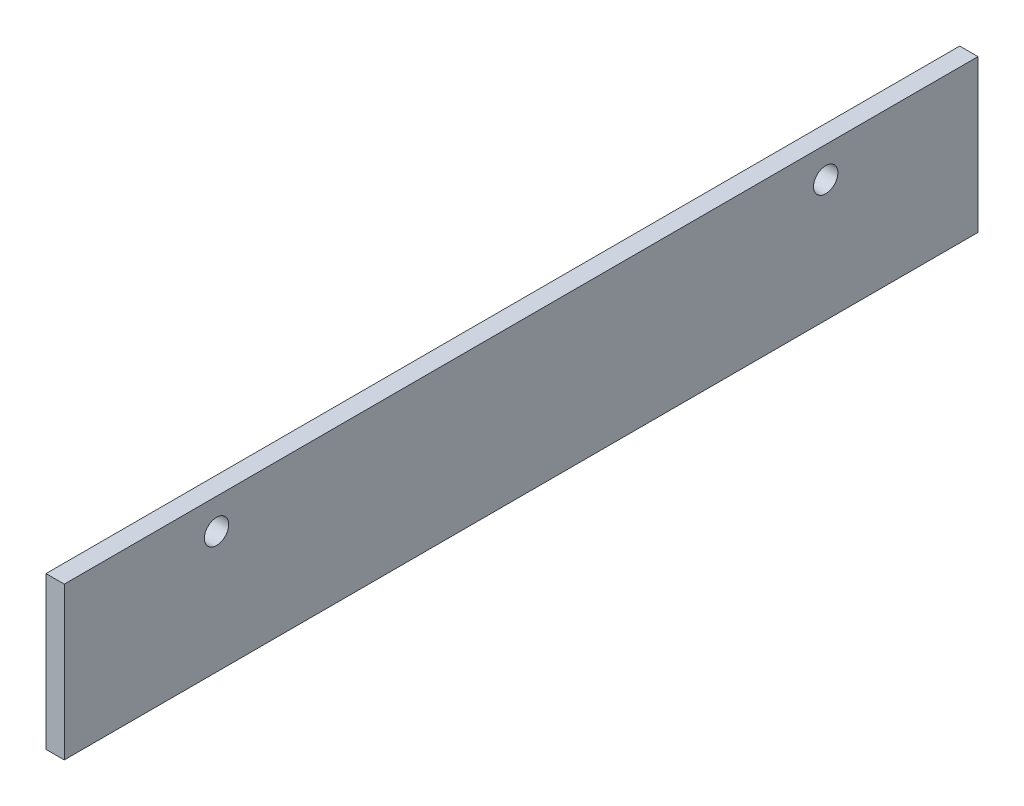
from build123d import *

# Parameters (mm, degrees)
SKETCH1_W          = 300
SKETCH1_H          = 50
EXTRUDE1_DEPTH     = 6
SKETCH2_R          = 4
CUT_EXTRUDE1_DEPTH = 6


with BuildPart() as part:
    # Sketch1 → Extrude1 (new body)
    with BuildSketch(Plane(origin=(0, 0, 0), x_dir=(0, 0, -1), z_dir=(1, 0, 0))):
        Rectangle(SKETCH1_W, SKETCH1_H)
    extrude(amount=EXTRUDE1_DEPTH)

    # Sketch2 → Cut-Extrude1 (cut)
    with BuildSketch(Plane(origin=(6, 0, 0), x_dir=(0, 0, -1), z_dir=(1, 0, 0))):
        with Locations((-100, 15)):
            Circle(SKETCH2_R)
        with Locations(Location((100, 15, 0), (0, 0, 180))):
            Circle(SKETCH2_R)
    extrude(amount=-CUT_EXTRUDE1_DEPTH, mode=Mode.SUBTRACT)


solid = part.part
